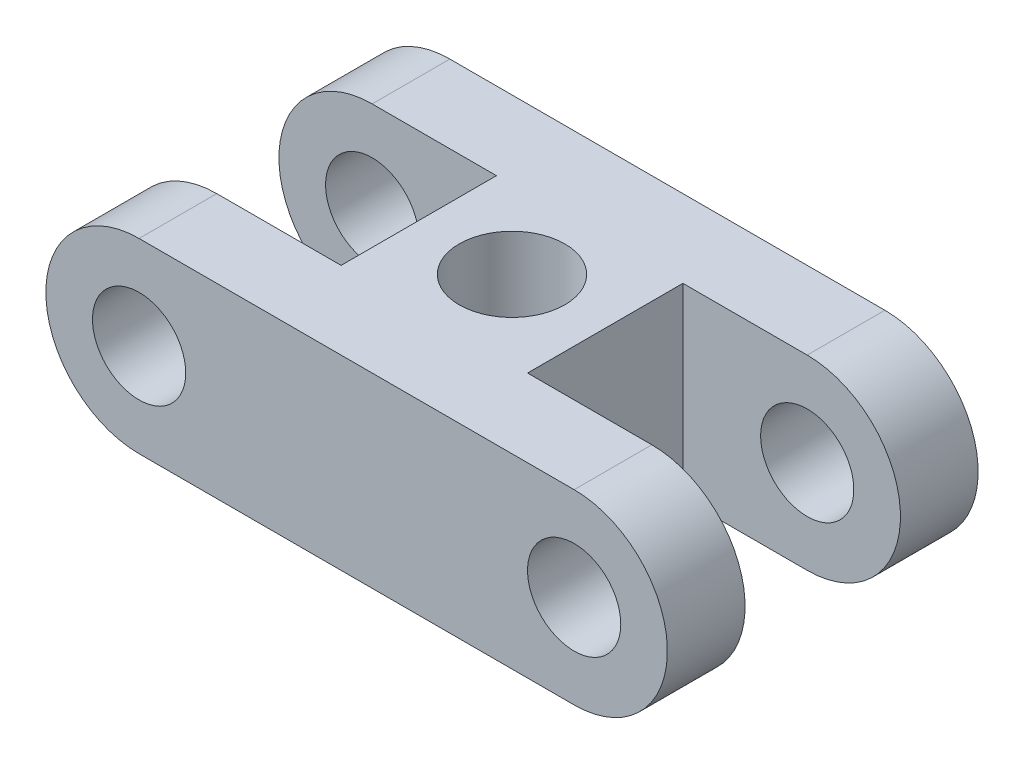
from build123d import *

# Parameters (mm, degrees)
SKETCH1_R               = 3
BOSS_EXTRUDE1_DEPTH     = 10
CUT_EXTRUDE1_DEPTH      = 26.377155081
CUT_EXTRUDE1_DEPTH_BACK = 26.377155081
SKETCH2_R               = 3.4
SKETCH2_W               = 28
SKETCH2_H               = 10


with BuildPart() as part:
    # Sketch1 → Boss-Extrude1 (new, symmetric)
    with BuildSketch(Plane.XY):
        with BuildLine():
            Line((-14, 6), (14, 6))
            ThreePointArc((14, 6), (20, 0), (14, -6))
            Line((14, -6), (-14, -6))
            ThreePointArc((-14, -6), (-20, 0), (-14, 6))
        make_face()
        with Locations((-14, 0)):
            Circle(SKETCH1_R, mode=Mode.SUBTRACT)
        with Locations((14, 0)):
            Circle(SKETCH1_R, mode=Mode.SUBTRACT)
    extrude(amount=BOSS_EXTRUDE1_DEPTH, both=True)

    # Sketch2 → Cut-Extrude1 (cut, two sides: drawn at the far end of the back side and taken through both)
    with BuildSketch(Plane(origin=(0, 6, 0), x_dir=(1, 0, 0), z_dir=(0, 1, 0)).offset(-CUT_EXTRUDE1_DEPTH_BACK)):
        with Locations(Location((0, 0, 0), (0, 0, 180))):
            Circle(SKETCH2_R)
        with Locations((-20, 0)):
            Rectangle(SKETCH2_W, SKETCH2_H)
        with Locations((20, 0)):
            Rectangle(SKETCH2_W, SKETCH2_H)
    extrude(amount=CUT_EXTRUDE1_DEPTH + CUT_EXTRUDE1_DEPTH_BACK, mode=Mode.SUBTRACT)


solid = part.part
